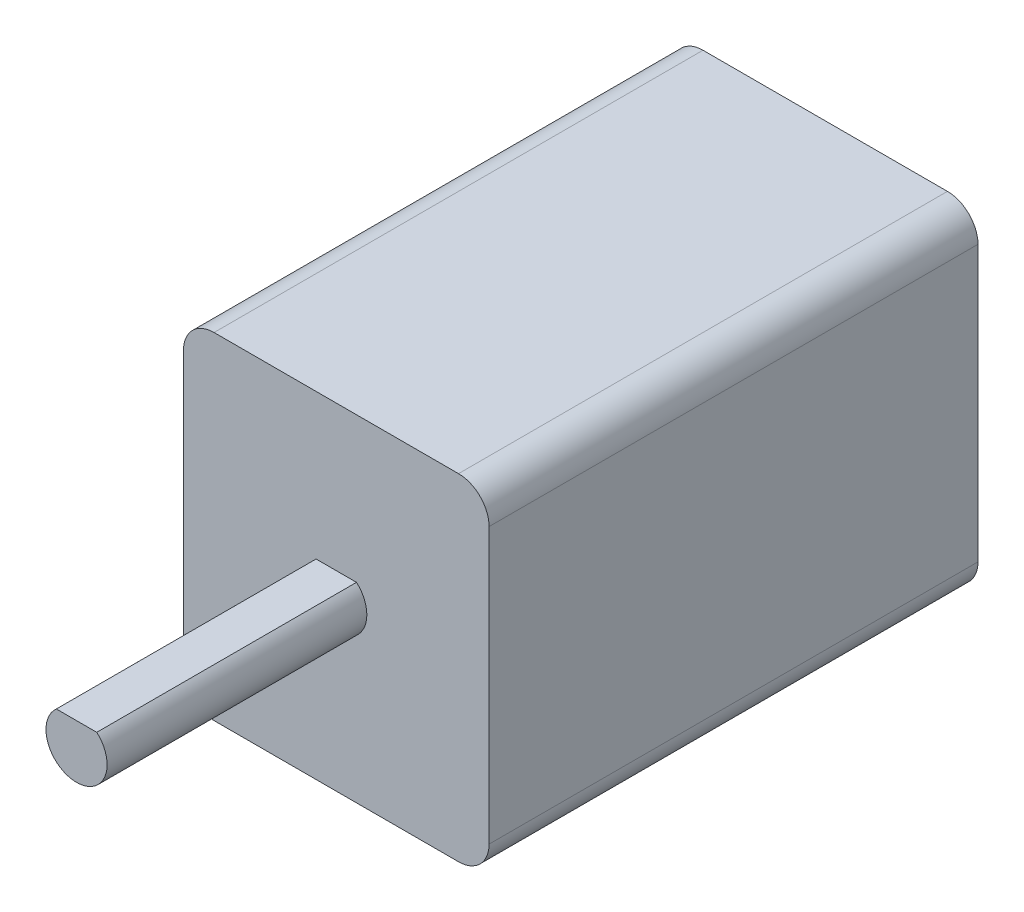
from build123d import *

# Parameters (mm, degrees)
SKETCH_1_W          = 20
SKETCH_1_H          = 22
EXTRUDE_1_DEPTH     = 32
FILLET_1_R          = 2
SKETCH_2_R          = 2
EXTRUDE_2_DEPTH     = 17
CUT_EXTRUDE_START   = -17
CUT_EXTRUDE_1_DEPTH = 17


with BuildPart() as part:
    # Sketch 1 → Extrude 1 (new body)
    with BuildSketch(Plane.XY):
        Rectangle(SKETCH_1_W, SKETCH_1_H)
    extrude(amount=EXTRUDE_1_DEPTH)

    # Fillet 1
    fillet_1_edges = [part.edges().sort_by_distance(p)[0] for p in [
        (10, -11, 16),
        (-10, -11, 16),
        (-10, 11, 16),
        (10, 11, 16),
    ]]
    fillet(fillet_1_edges, radius=FILLET_1_R)

    # Sketch 2 → Extrude 2 (add)
    with BuildSketch(Plane.XY.offset(32)):
        with Locations(Location((0, 0, 0), (0, 0, 180))):
            Circle(SKETCH_2_R)
    extrude(amount=EXTRUDE_2_DEPTH)

    # Sketch 3 → Cut-Extrude 1 (cut)
    with BuildSketch(Plane.XY.offset(49).offset(CUT_EXTRUDE_START)):
        with BuildLine():
            Line((-1.322875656, 1.5), (1.322875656, 1.5))
            ThreePointArc((1.322875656, 1.5), (0, 2), (-1.322875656, 1.5))
        make_face()
    extrude(amount=CUT_EXTRUDE_1_DEPTH, mode=Mode.SUBTRACT)


solid = part.part
